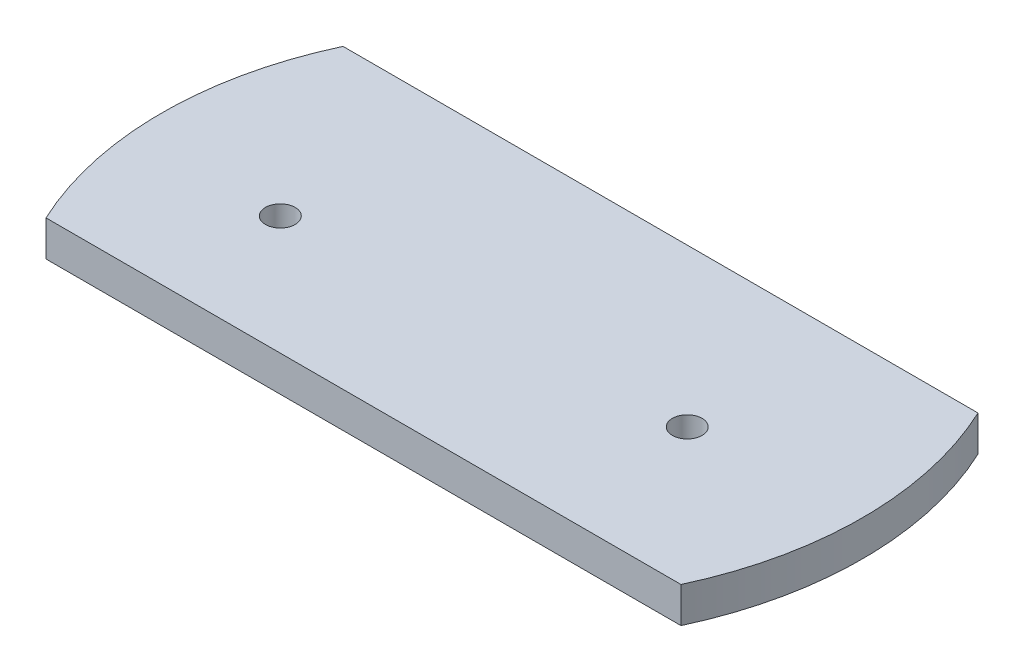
ISO-10303-21;
HEADER;
FILE_DESCRIPTION(('STEP AP214'),'2;1');
FILE_NAME('part.step','',(''),(''),'','','');
FILE_SCHEMA(('AUTOMOTIVE_DESIGN { 1 0 10303 214 1 1 1 1 }'));
ENDSEC;
DATA;
#1=APPLICATION_CONTEXT('core data for automotive mechanical design processes');
#2=APPLICATION_PROTOCOL_DEFINITION('international standard','automotive_design',2000,#1);
#3=PRODUCT_CONTEXT('',#1,'mechanical');
#4=PRODUCT('Part','Part','',(#3));
#5=PRODUCT_RELATED_PRODUCT_CATEGORY('part','',(#4));
#6=PRODUCT_DEFINITION_FORMATION('','',#4);
#7=PRODUCT_DEFINITION_CONTEXT('part definition',#1,'design');
#8=PRODUCT_DEFINITION('design','',#6,#7);
#9=PRODUCT_DEFINITION_SHAPE('','',#8);
#10=(LENGTH_UNIT() NAMED_UNIT(*) SI_UNIT(.MILLI.,.METRE.));
#11=(NAMED_UNIT(*) PLANE_ANGLE_UNIT() SI_UNIT($,.RADIAN.));
#12=(NAMED_UNIT(*) SI_UNIT($,.STERADIAN.) SOLID_ANGLE_UNIT());
#13=UNCERTAINTY_MEASURE_WITH_UNIT(LENGTH_MEASURE(1.E-05),#10,'distance_accuracy_value','');
#14=(GEOMETRIC_REPRESENTATION_CONTEXT(3) GLOBAL_UNCERTAINTY_ASSIGNED_CONTEXT((#13)) GLOBAL_UNIT_ASSIGNED_CONTEXT((#10,
#11,#12)) REPRESENTATION_CONTEXT('',''));
#15=CARTESIAN_POINT('',(0.,0.,0.));
#16=DIRECTION('',(0.,0.,1.));
#17=DIRECTION('',(1.,0.,0.));
#18=AXIS2_PLACEMENT_3D('',#15,#16,#17);
#19=CARTESIAN_POINT('',(59.,6.,-25.));
#20=DIRECTION('',(0.,-1.,0.));
#21=DIRECTION('',(0.,0.,-1.));
#22=AXIS2_PLACEMENT_3D('',#19,#20,#21);
#23=CYLINDRICAL_SURFACE('',#22,59.);
#24=CARTESIAN_POINT('',(59.,0.,-25.));
#25=DIRECTION('',(0.,1.,0.));
#26=DIRECTION('',(0.,0.,1.));
#27=AXIS2_PLACEMENT_3D('',#24,#25,#26);
#28=CIRCLE('',#27,59.);
#29=CARTESIAN_POINT('',(112.44155686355,0.,0.));
#30=VERTEX_POINT('',#29);
#31=CARTESIAN_POINT('',(112.44155686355,0.,-50.));
#32=VERTEX_POINT('',#31);
#33=EDGE_CURVE('E93',#30,#32,#28,.T.);
#34=ORIENTED_EDGE('',*,*,#33,.T.);
#35=DIRECTION('',(0.,-1.,0.));
#36=VECTOR('',#35,1.);
#37=CARTESIAN_POINT('',(112.44155686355,6.,-50.));
#38=LINE('',#37,#36);
#39=CARTESIAN_POINT('',(112.44155686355,6.,-50.));
#40=VERTEX_POINT('',#39);
#41=EDGE_CURVE('E11',#40,#32,#38,.T.);
#42=ORIENTED_EDGE('',*,*,#41,.F.);
#43=CARTESIAN_POINT('',(59.,6.,-25.));
#44=DIRECTION('',(0.,1.,0.));
#45=DIRECTION('',(0.,0.,1.));
#46=AXIS2_PLACEMENT_3D('',#43,#44,#45);
#47=CIRCLE('',#46,59.);
#48=CARTESIAN_POINT('',(112.44155686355,6.,0.));
#49=VERTEX_POINT('',#48);
#50=EDGE_CURVE('E81',#49,#40,#47,.T.);
#51=ORIENTED_EDGE('',*,*,#50,.F.);
#52=DIRECTION('',(0.,-1.,0.));
#53=VECTOR('',#52,1.);
#54=CARTESIAN_POINT('',(112.44155686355,6.,0.));
#55=LINE('',#54,#53);
#56=EDGE_CURVE('E89',#49,#30,#55,.T.);
#57=ORIENTED_EDGE('',*,*,#56,.T.);
#58=EDGE_LOOP('',(#34,#42,#51,#57));
#59=FACE_BOUND('',#58,.T.);
#60=ADVANCED_FACE('F30',(#59),#23,.T.);
#61=CARTESIAN_POINT('',(5.55844313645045,6.,-50.));
#62=DIRECTION('',(0.,0.,1.));
#63=DIRECTION('',(1.,0.,0.));
#64=AXIS2_PLACEMENT_3D('',#61,#62,#63);
#65=PLANE('',#64);
#66=DIRECTION('',(-1.,0.,0.));
#67=VECTOR('',#66,1.);
#68=CARTESIAN_POINT('',(5.55844313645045,0.,-50.));
#69=LINE('',#68,#67);
#70=CARTESIAN_POINT('',(5.55844313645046,0.,-50.));
#71=VERTEX_POINT('',#70);
#72=EDGE_CURVE('E85',#32,#71,#69,.T.);
#73=ORIENTED_EDGE('',*,*,#72,.T.);
#74=DIRECTION('',(0.,-1.,0.));
#75=VECTOR('',#74,1.);
#76=CARTESIAN_POINT('',(5.55844313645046,6.,-50.));
#77=LINE('',#76,#75);
#78=CARTESIAN_POINT('',(5.55844313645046,6.,-50.));
#79=VERTEX_POINT('',#78);
#80=EDGE_CURVE('E38',#79,#71,#77,.T.);
#81=ORIENTED_EDGE('',*,*,#80,.F.);
#82=DIRECTION('',(-1.,0.,0.));
#83=VECTOR('',#82,1.);
#84=CARTESIAN_POINT('',(5.55844313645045,6.,-50.));
#85=LINE('',#84,#83);
#86=EDGE_CURVE('E76',#40,#79,#85,.T.);
#87=ORIENTED_EDGE('',*,*,#86,.F.);
#88=ORIENTED_EDGE('',*,*,#41,.T.);
#89=EDGE_LOOP('',(#73,#81,#87,#88));
#90=FACE_BOUND('',#89,.T.);
#91=ADVANCED_FACE('F84',(#90),#65,.F.);
#92=CARTESIAN_POINT('',(59.,6.,-25.));
#93=DIRECTION('',(0.,-1.,0.));
#94=DIRECTION('',(0.,0.,-1.));
#95=AXIS2_PLACEMENT_3D('',#92,#93,#94);
#96=CYLINDRICAL_SURFACE('',#95,59.);
#97=CARTESIAN_POINT('',(59.,0.,-25.));
#98=DIRECTION('',(0.,1.,0.));
#99=DIRECTION('',(0.,0.,1.));
#100=AXIS2_PLACEMENT_3D('',#97,#98,#99);
#101=CIRCLE('',#100,59.);
#102=CARTESIAN_POINT('',(5.55844313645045,0.,0.));
#103=VERTEX_POINT('',#102);
#104=EDGE_CURVE('E63',#71,#103,#101,.T.);
#105=ORIENTED_EDGE('',*,*,#104,.T.);
#106=DIRECTION('',(0.,-1.,0.));
#107=VECTOR('',#106,1.);
#108=CARTESIAN_POINT('',(5.55844313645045,6.,0.));
#109=LINE('',#108,#107);
#110=CARTESIAN_POINT('',(5.55844313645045,6.,0.));
#111=VERTEX_POINT('',#110);
#112=EDGE_CURVE('E86',#111,#103,#109,.T.);
#113=ORIENTED_EDGE('',*,*,#112,.F.);
#114=CARTESIAN_POINT('',(59.,6.,-25.));
#115=DIRECTION('',(0.,1.,0.));
#116=DIRECTION('',(0.,0.,1.));
#117=AXIS2_PLACEMENT_3D('',#114,#115,#116);
#118=CIRCLE('',#117,59.);
#119=EDGE_CURVE('E79',#79,#111,#118,.T.);
#120=ORIENTED_EDGE('',*,*,#119,.F.);
#121=ORIENTED_EDGE('',*,*,#80,.T.);
#122=EDGE_LOOP('',(#105,#113,#120,#121));
#123=FACE_BOUND('',#122,.T.);
#124=ADVANCED_FACE('F87',(#123),#96,.T.);
#125=CARTESIAN_POINT('',(5.55844313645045,6.,0.));
#126=DIRECTION('',(0.,0.,-1.));
#127=DIRECTION('',(-1.,0.,0.));
#128=AXIS2_PLACEMENT_3D('',#125,#126,#127);
#129=PLANE('',#128);
#130=DIRECTION('',(1.,0.,0.));
#131=VECTOR('',#130,1.);
#132=CARTESIAN_POINT('',(5.55844313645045,0.,0.));
#133=LINE('',#132,#131);
#134=EDGE_CURVE('E69',#103,#30,#133,.T.);
#135=ORIENTED_EDGE('',*,*,#134,.T.);
#136=ORIENTED_EDGE('',*,*,#56,.F.);
#137=DIRECTION('',(1.,0.,0.));
#138=VECTOR('',#137,1.);
#139=CARTESIAN_POINT('',(5.55844313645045,6.,0.));
#140=LINE('',#139,#138);
#141=EDGE_CURVE('E46',#111,#49,#140,.T.);
#142=ORIENTED_EDGE('',*,*,#141,.F.);
#143=ORIENTED_EDGE('',*,*,#112,.T.);
#144=EDGE_LOOP('',(#135,#136,#142,#143));
#145=FACE_BOUND('',#144,.T.);
#146=ADVANCED_FACE('F101',(#145),#129,.F.);
#147=CARTESIAN_POINT('',(59.,6.,-25.));
#148=DIRECTION('',(0.,1.,0.));
#149=DIRECTION('',(0.,0.,1.));
#150=AXIS2_PLACEMENT_3D('',#147,#148,#149);
#151=PLANE('',#150);
#152=CARTESIAN_POINT('',(25.,6.,-20.));
#153=DIRECTION('',(0.,1.,0.));
#154=DIRECTION('',(0.,0.,1.));
#155=AXIS2_PLACEMENT_3D('',#152,#153,#154);
#156=CIRCLE('',#155,2.49999999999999);
#157=CARTESIAN_POINT('',(25.,6.,-17.5));
#158=VERTEX_POINT('',#157);
#159=EDGE_CURVE('E115',#158,#158,#156,.T.);
#160=ORIENTED_EDGE('',*,*,#159,.F.);
#161=EDGE_LOOP('',(#160));
#162=FACE_BOUND('',#161,.T.);
#163=CARTESIAN_POINT('',(90.,6.,-23.5));
#164=DIRECTION('',(0.,1.,0.));
#165=DIRECTION('',(0.,0.,1.));
#166=AXIS2_PLACEMENT_3D('',#163,#164,#165);
#167=CIRCLE('',#166,2.49999999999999);
#168=CARTESIAN_POINT('',(90.,6.,-21.));
#169=VERTEX_POINT('',#168);
#170=EDGE_CURVE('E109',#169,#169,#167,.T.);
#171=ORIENTED_EDGE('',*,*,#170,.F.);
#172=EDGE_LOOP('',(#171));
#173=FACE_BOUND('',#172,.T.);
#174=ORIENTED_EDGE('',*,*,#50,.T.);
#175=ORIENTED_EDGE('',*,*,#86,.T.);
#176=ORIENTED_EDGE('',*,*,#119,.T.);
#177=ORIENTED_EDGE('',*,*,#141,.T.);
#178=EDGE_LOOP('',(#174,#175,#176,#177));
#179=FACE_BOUND('',#178,.T.);
#180=ADVANCED_FACE('F77',(#162,#173,#179),#151,.T.);
#181=CARTESIAN_POINT('',(59.,0.,-25.));
#182=DIRECTION('',(0.,1.,0.));
#183=DIRECTION('',(0.,0.,1.));
#184=AXIS2_PLACEMENT_3D('',#181,#182,#183);
#185=PLANE('',#184);
#186=CARTESIAN_POINT('',(25.,0.,-20.));
#187=DIRECTION('',(0.,1.,0.));
#188=DIRECTION('',(0.,0.,1.));
#189=AXIS2_PLACEMENT_3D('',#186,#187,#188);
#190=CIRCLE('',#189,2.5);
#191=CARTESIAN_POINT('',(25.,0.,-17.5));
#192=VERTEX_POINT('',#191);
#193=EDGE_CURVE('E112',#192,#192,#190,.T.);
#194=ORIENTED_EDGE('',*,*,#193,.T.);
#195=EDGE_LOOP('',(#194));
#196=FACE_BOUND('',#195,.T.);
#197=CARTESIAN_POINT('',(90.,0.,-23.5));
#198=DIRECTION('',(0.,1.,0.));
#199=DIRECTION('',(0.,0.,1.));
#200=AXIS2_PLACEMENT_3D('',#197,#198,#199);
#201=CIRCLE('',#200,2.5);
#202=CARTESIAN_POINT('',(90.,0.,-21.));
#203=VERTEX_POINT('',#202);
#204=EDGE_CURVE('E96',#203,#203,#201,.T.);
#205=ORIENTED_EDGE('',*,*,#204,.T.);
#206=EDGE_LOOP('',(#205));
#207=FACE_BOUND('',#206,.T.);
#208=ORIENTED_EDGE('',*,*,#33,.F.);
#209=ORIENTED_EDGE('',*,*,#134,.F.);
#210=ORIENTED_EDGE('',*,*,#104,.F.);
#211=ORIENTED_EDGE('',*,*,#72,.F.);
#212=EDGE_LOOP('',(#208,#209,#210,#211));
#213=FACE_BOUND('',#212,.T.);
#214=ADVANCED_FACE('F104',(#196,#207,#213),#185,.F.);
#215=CARTESIAN_POINT('',(90.,6.,-23.5));
#216=DIRECTION('',(0.,1.,0.));
#217=DIRECTION('',(0.,0.,1.));
#218=AXIS2_PLACEMENT_3D('',#215,#216,#217);
#219=CYLINDRICAL_SURFACE('',#218,2.5);
#220=ORIENTED_EDGE('',*,*,#204,.F.);
#221=EDGE_LOOP('',(#220));
#222=FACE_BOUND('',#221,.T.);
#223=ORIENTED_EDGE('',*,*,#170,.T.);
#224=EDGE_LOOP('',(#223));
#225=FACE_BOUND('',#224,.T.);
#226=ADVANCED_FACE('F126',(#222,#225),#219,.F.);
#227=CARTESIAN_POINT('',(25.,6.,-20.));
#228=DIRECTION('',(0.,1.,0.));
#229=DIRECTION('',(0.,0.,1.));
#230=AXIS2_PLACEMENT_3D('',#227,#228,#229);
#231=CYLINDRICAL_SURFACE('',#230,2.49999999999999);
#232=ORIENTED_EDGE('',*,*,#193,.F.);
#233=EDGE_LOOP('',(#232));
#234=FACE_BOUND('',#233,.T.);
#235=ORIENTED_EDGE('',*,*,#159,.T.);
#236=EDGE_LOOP('',(#235));
#237=FACE_BOUND('',#236,.T.);
#238=ADVANCED_FACE('F119',(#234,#237),#231,.F.);
#239=CLOSED_SHELL('',(#60,#91,#124,#146,#180,#214,#226,#238));
#240=MANIFOLD_SOLID_BREP('B2',#239);
#241=ADVANCED_BREP_SHAPE_REPRESENTATION('',(#18,#240),#14);
#242=SHAPE_DEFINITION_REPRESENTATION(#9,#241);
ENDSEC;
END-ISO-10303-21;
